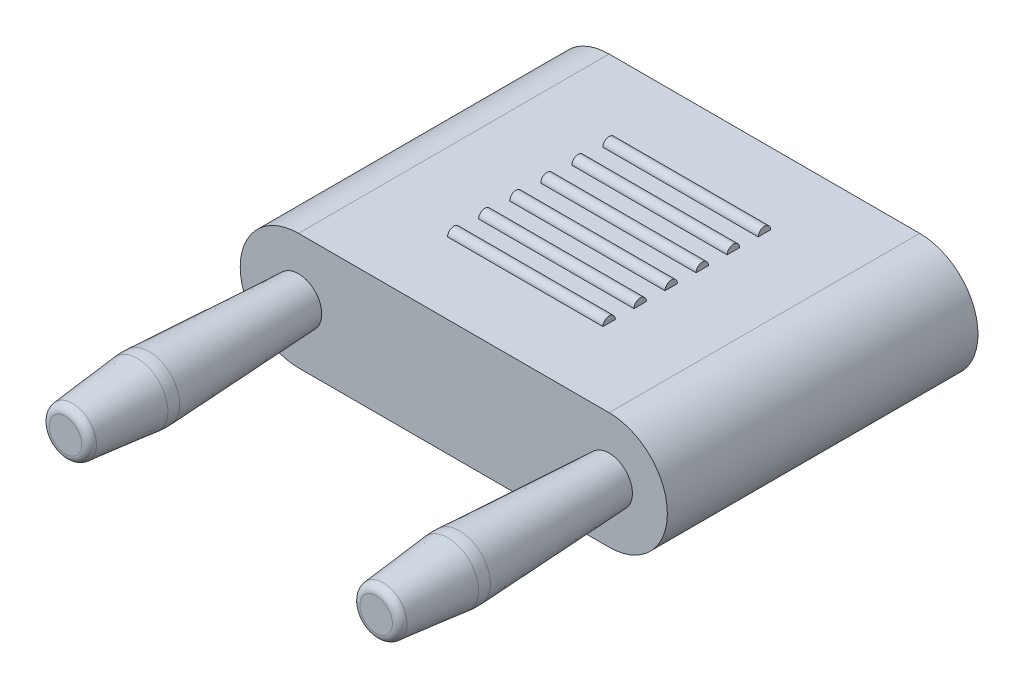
from build123d import *

# Parameters (mm, degrees)
EXTRUDE1_DEPTH     = 25.4
SKETCH3_R          = 1.905
CUT_EXTRUDE1_DEPTH = 6.35
LPATTERN1_COUNT    = 2
LPATTERN1_PITCH    = 25.4
EXTRUDE2_DEPTH     = 6.35
LPATTERN2_COUNT    = 6
LPATTERN2_PITCH    = 2.54


with BuildPart() as part:
    # Sketch1 → Extrude1 (new body)
    with BuildSketch(Plane.XY):
        with BuildLine():
            Line((-12.7, 4.7625), (12.7, 4.7625))
            ThreePointArc((12.7, 4.7625), (17.4625, 0), (12.7, -4.7625))
            Line((12.7, -4.7625), (-12.7, -4.7625))
            ThreePointArc((-12.7, -4.7625), (-17.4625, 0), (-12.7, 4.7625))
        make_face()
    extrude(amount=EXTRUDE1_DEPTH)

    # Sketch2 → Revolve1 (revolve)
    with BuildSketch(Plane(origin=(0, 0, 0), x_dir=(1, 0, 0), z_dir=(0, 1, 0))):
        with BuildLine():
            Line((-14.605, -25.4), (-15.216231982, -37.624639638))
            ThreePointArc((-15.216231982, -37.624639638), (-15.222193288, -38.099557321), (-15.192640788, -38.573592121))
            Line((-15.192640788, -38.573592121), (-14.662181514, -43.878184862))
            ThreePointArc((-14.662181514, -43.878184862), (-14.456421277, -44.285822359), (-14.030332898, -44.45))
            Line((-14.030332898, -44.45), (-12.7, -44.45))
            Line((-12.7, -44.45), (-12.7, -25.4))
            Line((-12.7, -25.4), (-14.605, -25.4))
        make_face()
    revolve1 = revolve(axis=Axis((-12.7, 0, 25.4), (0, 0, 1)))

    # Sketch3 → Cut-Extrude1 (cut)
    with BuildSketch(Plane(origin=(0, 0, 0), x_dir=(-1, 0, 0), z_dir=(0, 0, -1))):
        with Locations((12.7, 0)):
            Circle(SKETCH3_R)
    cut_extrude1 = extrude(amount=-CUT_EXTRUDE1_DEPTH, mode=Mode.SUBTRACT)

    # LPattern1: Revolve1, Cut-Extrude1 ×2
    with Locations(*[(i * LPATTERN1_PITCH, 0, 0) for i in range(1, LPATTERN1_COUNT)]):
        add(revolve1)
        add(cut_extrude1, mode=Mode.SUBTRACT)

    # Sketch4 → Extrude2 (add, symmetric)
    with BuildSketch(Plane(origin=(0, 0, 0), x_dir=(0, 0, -1), z_dir=(1, 0, 0))):
        with BuildLine():
            Line((-19.558, 4.7625), (-18.542, 4.7625))
            ThreePointArc((-18.542, 4.7625), (-19.05, 5.2705), (-19.558, 4.7625))
        make_face()
    extrude2 = extrude(amount=EXTRUDE2_DEPTH, both=True)

    # LPattern2: Extrude2 ×6
    with Locations(*[(0, 0, -i * LPATTERN2_PITCH) for i in range(1, LPATTERN2_COUNT)]):
        add(extrude2)


solid = part.part
